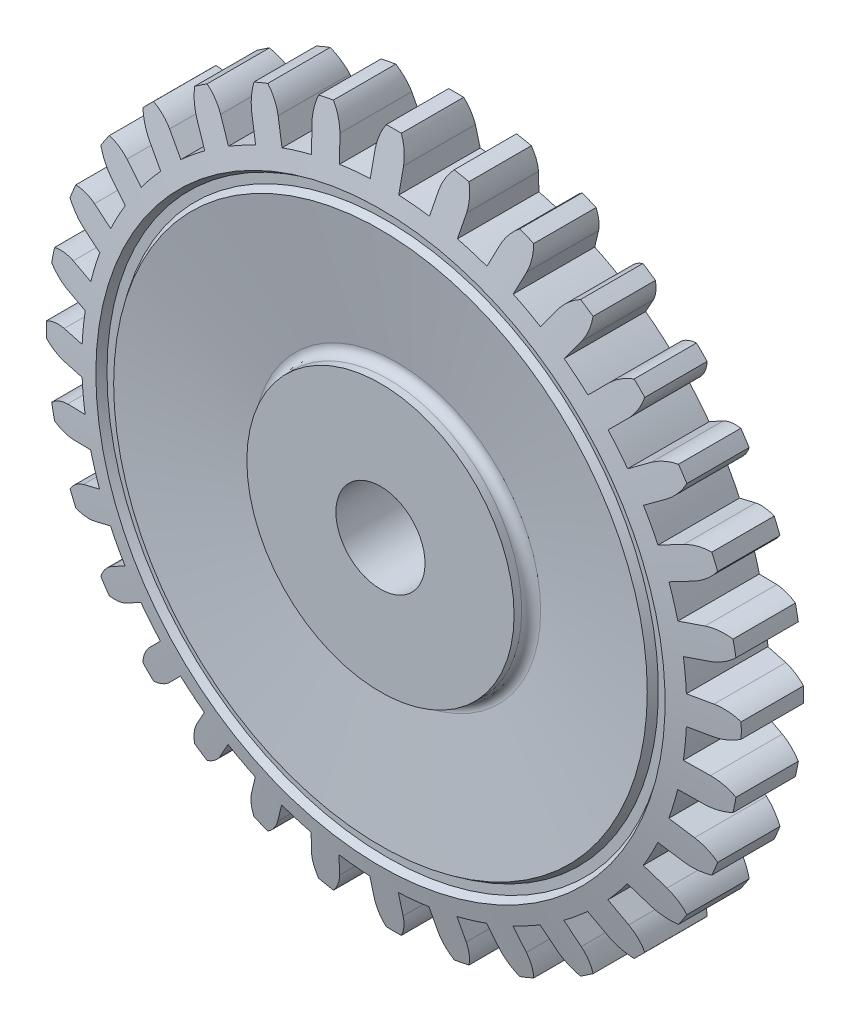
from build123d import *

# Parameters (mm, degrees)
SKETCH2_R               = 5
CUT_EXTRUDE1_DEPTH      = 46
CUT_EXTRUDE2_DEPTH      = 56.380501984
CUT_EXTRUDE2_DEPTH_BACK = 56.380501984


with BuildPart() as part:
    # Sketch1 → Revolve1 (revolve)
    with BuildSketch(Plane(origin=(0, 0, 0), x_dir=(0, 0, -1), z_dir=(1, 0, 0)), mode=Mode.PRIVATE) as revolve1_sk:
        Polygon((-5, 0), (5, 0), (5, 15), (4.142688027, 15), (-4.142688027, 15), (-5, 15), align=None)
        with BuildLine():
            Line((-4.142688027, 15), (4.142688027, 15))
            ThreePointArc((4.142688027, 15), (3.390159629, 15.3414402), (3.151518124, 16.13259798))
            Line((3.151518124, 16.13259798), (5, 29.95))
            Line((5, 29.95), (4.25, 30.45))
            Line((4.25, 30.45), (4.25, 31.45))
            Line((4.25, 31.45), (5, 31.95))
            Line((5, 31.95), (3.5, 39))
            Line((3.5, 39), (-3.5, 39))
            Line((-3.5, 39), (-5, 31.95))
            Line((-5, 31.95), (-4.25, 31.45))
            Line((-4.25, 31.45), (-4.25, 30.45))
            Line((-4.25, 30.45), (-5, 29.95))
            Line((-5, 29.95), (-3.151518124, 16.13259798))
            ThreePointArc((-3.151518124, 16.13259798), (-3.390159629, 15.3414402), (-4.142688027, 15))
        make_face()
    revolve(revolve1_sk.sketch.rotate(Axis((0, 0, -5), (0, 0, 1)), 90), axis=Axis((0, 0, -5), (0, 0, 1)))

    # Sketch2 → Cut-Extrude1 (cut)
    with BuildSketch(Plane(origin=(0, 0, -5), x_dir=(-1, 0, 0), z_dir=(0, 0, -1))):
        Circle(SKETCH2_R)
    extrude(amount=-CUT_EXTRUDE1_DEPTH, mode=Mode.SUBTRACT)

    # Sketch3 → Cut-Extrude2 (cut, two sides: drawn at the far end of the back side and taken through both)
    with BuildSketch(Plane.XY.offset(-CUT_EXTRUDE2_DEPTH_BACK)):
        with BuildLine():
            ThreePointArc((-1.576116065, 36.465954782), (-1.379740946, 37.777254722), (-0.845604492, 38.990831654))
            ThreePointArc((-0.845604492, 38.990831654), (-3.822548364, 38.81221617), (-6.777139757, 38.406644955))
            ThreePointArc((-6.777139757, 38.406644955), (-5.992524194, 37.32786425), (-5.521064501, 36.08002005))
            Line((-5.521064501, 36.08002005), (-5.023054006, 33.576352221))
            ThreePointArc((-5.023054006, 33.576352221), (-3.303885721, 33.78885673), (-1.576116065, 33.913394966))
            Line((-1.576116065, 33.913394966), (-1.576116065, 36.465954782))
        make_face()
        with BuildLine():
            ThreePointArc((6.777377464, 38.406603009), (3.822788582, 38.81219251), (0.845845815, 38.990826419))
            ThreePointArc((0.845845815, 38.990826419), (1.404925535, 37.77970328), (1.623883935, 36.463858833))
            Line((1.623883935, 36.463858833), (1.623883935, 33.911141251))
            ThreePointArc((1.623883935, 33.911141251), (3.351476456, 33.784169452), (5.070343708, 33.569243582))
            Line((5.070343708, 33.569243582), (5.568323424, 36.072756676))
            ThreePointArc((5.568323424, 36.072756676), (6.016747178, 37.320549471), (6.777377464, 38.406603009))
        make_face()
        with BuildLine():
            ThreePointArc((14.139908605, 36.34643015), (11.321217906, 37.320638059), (8.436326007, 38.07661229))
            ThreePointArc((8.436326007, 38.07661229), (8.748384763, 36.7796895), (8.706427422, 35.44641197))
            Line((8.706427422, 35.44641197), (8.208416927, 32.942744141))
            ThreePointArc((8.208416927, 32.942744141), (9.878043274, 32.481175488), (11.521953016, 31.935044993))
            Line((11.521953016, 31.935044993), (12.498775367, 34.293302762))
            ThreePointArc((12.498775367, 34.293302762), (13.182015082, 35.429636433), (14.139908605, 36.34643015))
        make_face()
        with BuildLine():
            Line((15.454387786, 33.066779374), (14.47750506, 30.708375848))
            ThreePointArc((14.47750506, 30.708375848), (16.025002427, 29.929948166), (17.530780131, 29.073600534))
            Line((17.530780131, 29.073600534), (18.948906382, 31.195976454))
            ThreePointArc((18.948906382, 31.195976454), (19.840705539, 32.177182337), (20.959050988, 32.889484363))
            ThreePointArc((20.959050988, 32.889484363), (18.384579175, 34.394872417), (15.702602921, 35.699135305))
            ThreePointArc((15.702602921, 35.699135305), (15.755648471, 34.366252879), (15.454387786, 33.066779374))
        make_face()
        with BuildLine():
            ThreePointArc((-8.659986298, 35.457786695), (-8.7232064, 36.78220126), (-8.436090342, 38.076664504))
            ThreePointArc((-8.436090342, 38.076664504), (-11.32098692, 37.320708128), (-14.139683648, 36.346517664))
            ThreePointArc((-14.139683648, 36.346517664), (-13.159684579, 35.441536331), (-12.453841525, 34.30964633))
            Line((-12.453841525, 34.30964633), (-11.476958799, 31.951242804))
            ThreePointArc((-11.476958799, 31.951242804), (-9.832281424, 32.495057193), (-8.162006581, 32.954273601))
            Line((-8.162006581, 32.954273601), (-8.659986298, 35.457786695))
        make_face()
        with BuildLine():
            ThreePointArc((-17.489810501, 29.098265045), (-15.982828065, 29.952490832), (-14.434235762, 30.728737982))
            Line((-14.434235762, 30.728737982), (-15.411058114, 33.086995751))
            ThreePointArc((-15.411058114, 33.086995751), (-15.731443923, 34.373628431), (-15.702381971, 35.699232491))
            ThreePointArc((-15.702381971, 35.699232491), (-18.384366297, 34.394986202), (-20.958847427, 32.889614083))
            ThreePointArc((-20.958847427, 32.889614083), (-19.821125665, 32.193210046), (-18.908024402, 31.220772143))
            Line((-18.908024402, 31.220772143), (-17.489810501, 29.098265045))
        make_face()
        with BuildLine():
            ThreePointArc((-22.830538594, 25.127057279), (-21.519163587, 26.258867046), (-20.151765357, 27.322314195))
            Line((-20.151765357, 27.322314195), (-21.569891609, 29.444690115))
            ThreePointArc((-21.569891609, 29.444690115), (-22.135130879, 30.644096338), (-22.365239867, 31.949898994))
            ThreePointArc((-22.365239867, 31.949898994), (-24.741244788, 30.147484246), (-26.972574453, 28.168781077))
            ThreePointArc((-26.972574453, 28.168781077), (-25.720852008, 27.707716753), (-24.635582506, 26.932101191))
            Line((-24.635582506, 26.932101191), (-22.830538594, 25.127057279))
        make_face()
        with BuildLine():
            ThreePointArc((-27.293901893, 20.190230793), (-26.22852972, 21.556129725), (-25.094873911, 22.865909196))
            Line((-25.094873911, 22.865909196), (-26.899806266, 24.670841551))
            ThreePointArc((-26.899806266, 24.670841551), (-27.688177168, 25.736928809), (-28.168614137, 26.972748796))
            ThreePointArc((-28.168614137, 26.972748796), (-30.147331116, 24.741431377), (-31.949760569, 22.365437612))
            ThreePointArc((-31.949760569, 22.365437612), (-30.632140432, 22.157431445), (-29.41640899, 21.608444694))
            Line((-29.41640899, 21.608444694), (-27.293901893, 20.190230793))
        make_face()
        with BuildLine():
            ThreePointArc((-30.708375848, 14.47750506), (-29.929948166, 16.025002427), (-29.073600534, 17.530780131))
            Line((-29.073600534, 17.530780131), (-31.195976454, 18.948906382))
            ThreePointArc((-31.195976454, 18.948906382), (-32.177182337, 19.840705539), (-32.889484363, 20.959050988))
            ThreePointArc((-32.889484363, 20.959050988), (-34.394872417, 18.384579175), (-35.699135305, 15.702602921))
            ThreePointArc((-35.699135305, 15.702602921), (-34.366252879, 15.755648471), (-33.066779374, 15.454387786))
            Line((-33.066779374, 15.454387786), (-30.708375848, 14.47750506))
        make_face()
        with BuildLine():
            ThreePointArc((-32.942744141, 8.208416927), (-32.481175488, 9.878043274), (-31.935044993, 11.521953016))
            Line((-31.935044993, 11.521953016), (-34.293302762, 12.498775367))
            ThreePointArc((-34.293302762, 12.498775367), (-35.429636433, 13.182015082), (-36.34643015, 14.139908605))
            ThreePointArc((-36.34643015, 14.139908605), (-37.320638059, 11.321217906), (-38.07661229, 8.436326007))
            ThreePointArc((-38.07661229, 8.436326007), (-36.7796895, 8.748384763), (-35.44641197, 8.706427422))
            Line((-35.44641197, 8.706427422), (-32.942744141, 8.208416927))
        make_face()
        with BuildLine():
            ThreePointArc((-33.911141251, 1.623883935), (-33.784169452, 3.351476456), (-33.569243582, 5.070343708))
            Line((-33.569243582, 5.070343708), (-36.072756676, 5.568323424))
            ThreePointArc((-36.072756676, 5.568323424), (-37.320549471, 6.016747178), (-38.406603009, 6.777377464))
            ThreePointArc((-38.406603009, 6.777377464), (-38.81219251, 3.822788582), (-38.990826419, 0.845845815))
            ThreePointArc((-38.990826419, 0.845845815), (-37.77970328, 1.404925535), (-36.463858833, 1.623883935))
            Line((-36.463858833, 1.623883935), (-33.911141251, 1.623883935))
        make_face()
        with BuildLine():
            ThreePointArc((-33.576352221, -5.023054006), (-33.78885673, -3.303885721), (-33.913394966, -1.576116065))
            Line((-33.913394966, -1.576116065), (-36.465954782, -1.576116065))
            ThreePointArc((-36.465954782, -1.576116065), (-37.777254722, -1.379740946), (-38.990831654, -0.845604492))
            ThreePointArc((-38.990831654, -0.845604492), (-38.81221617, -3.822548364), (-38.406644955, -6.777139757))
            ThreePointArc((-38.406644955, -6.777139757), (-37.32786425, -5.992524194), (-36.08002005, -5.521064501))
            Line((-36.08002005, -5.521064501), (-33.576352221, -5.023054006))
        make_face()
        with BuildLine():
            ThreePointArc((-31.951242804, -11.476958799), (-32.495057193, -9.832281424), (-32.954273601, -8.162006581))
            Line((-32.954273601, -8.162006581), (-35.457786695, -8.659986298))
            ThreePointArc((-35.457786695, -8.659986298), (-36.78220126, -8.7232064), (-38.076664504, -8.436090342))
            ThreePointArc((-38.076664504, -8.436090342), (-37.320708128, -11.32098692), (-36.346517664, -14.139683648))
            ThreePointArc((-36.346517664, -14.139683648), (-35.441536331, -13.159684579), (-34.30964633, -12.453841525))
            Line((-34.30964633, -12.453841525), (-31.951242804, -11.476958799))
        make_face()
        with BuildLine():
            ThreePointArc((-29.098265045, -17.489810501), (-29.952490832, -15.982828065), (-30.728737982, -14.434235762))
            Line((-30.728737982, -14.434235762), (-33.086995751, -15.411058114))
            ThreePointArc((-33.086995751, -15.411058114), (-34.373628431, -15.731443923), (-35.699232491, -15.702381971))
            ThreePointArc((-35.699232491, -15.702381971), (-34.394986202, -18.384366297), (-32.889614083, -20.958847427))
            ThreePointArc((-32.889614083, -20.958847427), (-32.193210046, -19.821125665), (-31.220772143, -18.908024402))
            Line((-31.220772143, -18.908024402), (-29.098265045, -17.489810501))
        make_face()
        with BuildLine():
            ThreePointArc((-20.190230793, -27.293901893), (-21.556129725, -26.22852972), (-22.865909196, -25.094873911))
            Line((-22.865909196, -25.094873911), (-24.670841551, -26.899806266))
            ThreePointArc((-24.670841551, -26.899806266), (-25.736928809, -27.688177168), (-26.972748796, -28.168614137))
            ThreePointArc((-26.972748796, -28.168614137), (-24.741431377, -30.147331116), (-22.365437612, -31.949760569))
            ThreePointArc((-22.365437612, -31.949760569), (-22.157431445, -30.632140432), (-21.608444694, -29.41640899))
            Line((-21.608444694, -29.41640899), (-20.190230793, -27.293901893))
        make_face()
        with BuildLine():
            ThreePointArc((-14.47750506, -30.708375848), (-16.025002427, -29.929948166), (-17.530780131, -29.073600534))
            Line((-17.530780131, -29.073600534), (-18.948906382, -31.195976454))
            ThreePointArc((-18.948906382, -31.195976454), (-19.840705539, -32.177182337), (-20.959050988, -32.889484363))
            ThreePointArc((-20.959050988, -32.889484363), (-18.384579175, -34.394872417), (-15.702602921, -35.699135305))
            ThreePointArc((-15.702602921, -35.699135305), (-15.755648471, -34.366252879), (-15.454387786, -33.066779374))
            Line((-15.454387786, -33.066779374), (-14.47750506, -30.708375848))
        make_face()
        with BuildLine():
            ThreePointArc((-8.208416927, -32.942744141), (-9.878043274, -32.481175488), (-11.521953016, -31.935044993))
            Line((-11.521953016, -31.935044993), (-12.498775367, -34.293302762))
            ThreePointArc((-12.498775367, -34.293302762), (-13.182015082, -35.429636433), (-14.139908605, -36.34643015))
            ThreePointArc((-14.139908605, -36.34643015), (-11.321217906, -37.320638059), (-8.436326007, -38.07661229))
            ThreePointArc((-8.436326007, -38.07661229), (-8.748384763, -36.7796895), (-8.706427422, -35.44641197))
            Line((-8.706427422, -35.44641197), (-8.208416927, -32.942744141))
        make_face()
        with BuildLine():
            ThreePointArc((-1.623883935, -33.911141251), (-3.351476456, -33.784169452), (-5.070343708, -33.569243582))
            Line((-5.070343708, -33.569243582), (-5.568323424, -36.072756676))
            ThreePointArc((-5.568323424, -36.072756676), (-6.016747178, -37.320549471), (-6.777377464, -38.406603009))
            ThreePointArc((-6.777377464, -38.406603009), (-3.822788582, -38.81219251), (-0.845845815, -38.990826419))
            ThreePointArc((-0.845845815, -38.990826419), (-1.404925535, -37.77970328), (-1.623883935, -36.463858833))
            Line((-1.623883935, -36.463858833), (-1.623883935, -33.911141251))
        make_face()
        with BuildLine():
            Line((5.521064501, -36.08002005), (5.023054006, -33.576352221))
            ThreePointArc((5.023054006, -33.576352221), (3.303885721, -33.78885673), (1.576116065, -33.913394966))
            Line((1.576116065, -33.913394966), (1.576116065, -36.465954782))
            ThreePointArc((1.576116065, -36.465954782), (1.379740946, -37.777254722), (0.845604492, -38.990831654))
            ThreePointArc((0.845604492, -38.990831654), (3.822548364, -38.81221617), (6.777139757, -38.406644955))
            ThreePointArc((6.777139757, -38.406644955), (5.992524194, -37.32786425), (5.521064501, -36.08002005))
        make_face()
        with BuildLine():
            Line((12.453841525, -34.30964633), (11.476958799, -31.951242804))
            ThreePointArc((11.476958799, -31.951242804), (9.832281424, -32.495057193), (8.162006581, -32.954273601))
            Line((8.162006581, -32.954273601), (8.659986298, -35.457786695))
            ThreePointArc((8.659986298, -35.457786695), (8.7232064, -36.78220126), (8.436090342, -38.076664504))
            ThreePointArc((8.436090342, -38.076664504), (11.32098692, -37.320708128), (14.139683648, -36.346517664))
            ThreePointArc((14.139683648, -36.346517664), (13.159684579, -35.441536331), (12.453841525, -34.30964633))
        make_face()
        with BuildLine():
            Line((18.908024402, -31.220772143), (17.489810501, -29.098265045))
            ThreePointArc((17.489810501, -29.098265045), (15.982828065, -29.952490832), (14.434235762, -30.728737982))
            Line((14.434235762, -30.728737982), (15.411058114, -33.086995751))
            ThreePointArc((15.411058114, -33.086995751), (15.731443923, -34.373628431), (15.702381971, -35.699232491))
            ThreePointArc((15.702381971, -35.699232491), (18.384366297, -34.394986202), (20.958847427, -32.889614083))
            ThreePointArc((20.958847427, -32.889614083), (19.821125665, -32.193210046), (18.908024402, -31.220772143))
        make_face()
        with BuildLine():
            Line((24.635582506, -26.932101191), (22.830538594, -25.127057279))
            ThreePointArc((22.830538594, -25.127057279), (21.519163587, -26.258867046), (20.151765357, -27.322314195))
            Line((20.151765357, -27.322314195), (21.569891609, -29.444690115))
            ThreePointArc((21.569891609, -29.444690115), (22.135130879, -30.644096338), (22.365239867, -31.949898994))
            ThreePointArc((22.365239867, -31.949898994), (24.741244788, -30.147484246), (26.972574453, -28.168781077))
            ThreePointArc((26.972574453, -28.168781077), (25.720852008, -27.707716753), (24.635582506, -26.932101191))
        make_face()
        with BuildLine():
            Line((29.41640899, -21.608444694), (27.293901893, -20.190230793))
            ThreePointArc((27.293901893, -20.190230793), (26.22852972, -21.556129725), (25.094873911, -22.865909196))
            Line((25.094873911, -22.865909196), (26.899806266, -24.670841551))
            ThreePointArc((26.899806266, -24.670841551), (27.688177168, -25.736928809), (28.168614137, -26.972748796))
            ThreePointArc((28.168614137, -26.972748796), (30.147331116, -24.741431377), (31.949760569, -22.365437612))
            ThreePointArc((31.949760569, -22.365437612), (30.632140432, -22.157431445), (29.41640899, -21.608444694))
        make_face()
        with BuildLine():
            Line((33.066779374, -15.454387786), (30.708375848, -14.47750506))
            ThreePointArc((30.708375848, -14.47750506), (29.929948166, -16.025002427), (29.073600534, -17.530780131))
            Line((29.073600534, -17.530780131), (31.195976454, -18.948906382))
            ThreePointArc((31.195976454, -18.948906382), (32.177182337, -19.840705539), (32.889484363, -20.959050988))
            ThreePointArc((32.889484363, -20.959050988), (34.394872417, -18.384579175), (35.699135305, -15.702602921))
            ThreePointArc((35.699135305, -15.702602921), (34.366252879, -15.755648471), (33.066779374, -15.454387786))
        make_face()
        with BuildLine():
            Line((35.44641197, -8.706427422), (32.942744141, -8.208416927))
            ThreePointArc((32.942744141, -8.208416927), (32.481175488, -9.878043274), (31.935044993, -11.521953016))
            Line((31.935044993, -11.521953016), (34.293302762, -12.498775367))
            ThreePointArc((34.293302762, -12.498775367), (35.429636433, -13.182015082), (36.34643015, -14.139908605))
            ThreePointArc((36.34643015, -14.139908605), (37.320638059, -11.321217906), (38.07661229, -8.436326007))
            ThreePointArc((38.07661229, -8.436326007), (36.7796895, -8.748384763), (35.44641197, -8.706427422))
        make_face()
        with BuildLine():
            Line((36.463858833, -1.623883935), (33.911141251, -1.623883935))
            ThreePointArc((33.911141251, -1.623883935), (33.784169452, -3.351476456), (33.569243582, -5.070343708))
            Line((33.569243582, -5.070343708), (36.072756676, -5.568323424))
            ThreePointArc((36.072756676, -5.568323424), (37.320549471, -6.016747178), (38.406603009, -6.777377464))
            ThreePointArc((38.406603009, -6.777377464), (38.81219251, -3.822788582), (38.990826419, -0.845845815))
            ThreePointArc((38.990826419, -0.845845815), (37.77970328, -1.404925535), (36.463858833, -1.623883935))
        make_face()
        with BuildLine():
            Line((36.08002005, 5.521064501), (33.576352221, 5.023054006))
            ThreePointArc((33.576352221, 5.023054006), (33.78885673, 3.303885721), (33.913394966, 1.576116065))
            Line((33.913394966, 1.576116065), (36.465954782, 1.576116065))
            ThreePointArc((36.465954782, 1.576116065), (37.777254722, 1.379740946), (38.990831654, 0.845604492))
            ThreePointArc((38.990831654, 0.845604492), (38.81221617, 3.822548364), (38.406644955, 6.777139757))
            ThreePointArc((38.406644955, 6.777139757), (37.32786425, 5.992524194), (36.08002005, 5.521064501))
        make_face()
        with BuildLine():
            Line((34.30964633, 12.453841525), (31.951242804, 11.476958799))
            ThreePointArc((31.951242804, 11.476958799), (32.495057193, 9.832281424), (32.954273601, 8.162006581))
            Line((32.954273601, 8.162006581), (35.457786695, 8.659986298))
            ThreePointArc((35.457786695, 8.659986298), (36.78220126, 8.7232064), (38.076664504, 8.436090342))
            ThreePointArc((38.076664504, 8.436090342), (37.320708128, 11.32098692), (36.346517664, 14.139683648))
            ThreePointArc((36.346517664, 14.139683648), (35.441536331, 13.159684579), (34.30964633, 12.453841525))
        make_face()
        with BuildLine():
            Line((21.608444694, 29.41640899), (20.190230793, 27.293901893))
            ThreePointArc((20.190230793, 27.293901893), (21.556129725, 26.22852972), (22.865909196, 25.094873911))
            Line((22.865909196, 25.094873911), (24.670841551, 26.899806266))
            ThreePointArc((24.670841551, 26.899806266), (25.736928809, 27.688177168), (26.972748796, 28.168614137))
            ThreePointArc((26.972748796, 28.168614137), (24.741431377, 30.147331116), (22.365437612, 31.949760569))
            ThreePointArc((22.365437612, 31.949760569), (22.157431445, 30.632140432), (21.608444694, 29.41640899))
        make_face()
        with BuildLine():
            Line((26.932101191, 24.635582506), (25.127057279, 22.830538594))
            ThreePointArc((25.127057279, 22.830538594), (26.258867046, 21.519163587), (27.322314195, 20.151765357))
            Line((27.322314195, 20.151765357), (29.444690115, 21.569891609))
            ThreePointArc((29.444690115, 21.569891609), (30.644096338, 22.135130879), (31.949898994, 22.365239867))
            ThreePointArc((31.949898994, 22.365239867), (30.147484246, 24.741244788), (28.168781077, 26.972574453))
            ThreePointArc((28.168781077, 26.972574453), (27.707716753, 25.720852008), (26.932101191, 24.635582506))
        make_face()
        with BuildLine():
            Line((31.220772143, 18.908024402), (29.098265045, 17.489810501))
            ThreePointArc((29.098265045, 17.489810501), (29.952490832, 15.982828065), (30.728737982, 14.434235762))
            Line((30.728737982, 14.434235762), (33.086995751, 15.411058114))
            ThreePointArc((33.086995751, 15.411058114), (34.373628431, 15.731443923), (35.699232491, 15.702381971))
            ThreePointArc((35.699232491, 15.702381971), (34.394986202, 18.384366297), (32.889614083, 20.958847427))
            ThreePointArc((32.889614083, 20.958847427), (32.193210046, 19.821125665), (31.220772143, 18.908024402))
        make_face()
        with BuildLine():
            ThreePointArc((-25.127057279, -22.830538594), (-26.258867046, -21.519163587), (-27.322314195, -20.151765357))
            Line((-27.322314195, -20.151765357), (-29.444690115, -21.569891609))
            ThreePointArc((-29.444690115, -21.569891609), (-30.644096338, -22.135130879), (-31.949898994, -22.365239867))
            ThreePointArc((-31.949898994, -22.365239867), (-30.147484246, -24.741244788), (-28.168781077, -26.972574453))
            ThreePointArc((-28.168781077, -26.972574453), (-27.707716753, -25.720852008), (-26.932101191, -24.635582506))
            Line((-26.932101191, -24.635582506), (-25.127057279, -22.830538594))
        make_face()
    extrude(amount=CUT_EXTRUDE2_DEPTH + CUT_EXTRUDE2_DEPTH_BACK, mode=Mode.SUBTRACT)


solid = part.part
